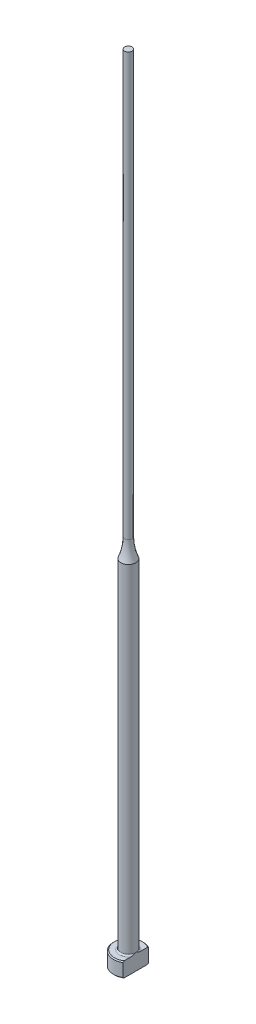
ISO-10303-21;
HEADER;
FILE_DESCRIPTION(('STEP AP214'),'2;1');
FILE_NAME('part.step','',(''),(''),'','','');
FILE_SCHEMA(('AUTOMOTIVE_DESIGN { 1 0 10303 214 1 1 1 1 }'));
ENDSEC;
DATA;
#1=APPLICATION_CONTEXT('core data for automotive mechanical design processes');
#2=APPLICATION_PROTOCOL_DEFINITION('international standard','automotive_design',2000,#1);
#3=PRODUCT_CONTEXT('',#1,'mechanical');
#4=PRODUCT('Part','Part','',(#3));
#5=PRODUCT_RELATED_PRODUCT_CATEGORY('part','',(#4));
#6=PRODUCT_DEFINITION_FORMATION('','',#4);
#7=PRODUCT_DEFINITION_CONTEXT('part definition',#1,'design');
#8=PRODUCT_DEFINITION('design','',#6,#7);
#9=PRODUCT_DEFINITION_SHAPE('','',#8);
#10=(LENGTH_UNIT() NAMED_UNIT(*) SI_UNIT(.MILLI.,.METRE.));
#11=(NAMED_UNIT(*) PLANE_ANGLE_UNIT() SI_UNIT($,.RADIAN.));
#12=(NAMED_UNIT(*) SI_UNIT($,.STERADIAN.) SOLID_ANGLE_UNIT());
#13=UNCERTAINTY_MEASURE_WITH_UNIT(LENGTH_MEASURE(1.E-05),#10,'distance_accuracy_value','');
#14=(GEOMETRIC_REPRESENTATION_CONTEXT(3) GLOBAL_UNCERTAINTY_ASSIGNED_CONTEXT((#13)) GLOBAL_UNIT_ASSIGNED_CONTEXT((#10,
#11,#12)) REPRESENTATION_CONTEXT('',''));
#15=CARTESIAN_POINT('',(0.,0.,0.));
#16=DIRECTION('',(0.,0.,1.));
#17=DIRECTION('',(1.,0.,0.));
#18=AXIS2_PLACEMENT_3D('',#15,#16,#17);
#19=CARTESIAN_POINT('',(-2.99999999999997,3.,0.));
#20=DIRECTION('',(0.,1.,0.));
#21=DIRECTION('',(0.,0.,1.));
#22=AXIS2_PLACEMENT_3D('',#19,#20,#21);
#23=PLANE('',#22);
#24=CARTESIAN_POINT('',(0.,3.,0.));
#25=DIRECTION('',(0.,1.,0.));
#26=DIRECTION('',(0.,0.,1.));
#27=AXIS2_PLACEMENT_3D('',#24,#25,#26);
#28=CIRCLE('',#27,2.79999999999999);
#29=CARTESIAN_POINT('',(1.49999999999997,3.,-2.36431808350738));
#30=VERTEX_POINT('',#29);
#31=CARTESIAN_POINT('',(1.49999999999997,3.,2.36431808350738));
#32=VERTEX_POINT('',#31);
#33=EDGE_CURVE('E187',#30,#32,#28,.T.);
#34=ORIENTED_EDGE('',*,*,#33,.T.);
#35=DIRECTION('',(0.,0.,-1.));
#36=VECTOR('',#35,1.);
#37=CARTESIAN_POINT('',(1.49999999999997,3.,0.));
#38=LINE('',#37,#36);
#39=CARTESIAN_POINT('',(1.49999999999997,3.00000000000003,0.99498743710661));
#40=VERTEX_POINT('',#39);
#41=EDGE_CURVE('E57',#32,#40,#38,.T.);
#42=ORIENTED_EDGE('',*,*,#41,.T.);
#43=CARTESIAN_POINT('',(0.,3.,0.));
#44=DIRECTION('',(0.,1.,0.));
#45=DIRECTION('',(0.,0.,1.));
#46=AXIS2_PLACEMENT_3D('',#43,#44,#45);
#47=CIRCLE('',#46,1.79999999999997);
#48=CARTESIAN_POINT('',(1.49999999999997,3.00000000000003,-0.994987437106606));
#49=VERTEX_POINT('',#48);
#50=EDGE_CURVE('E108',#40,#49,#47,.F.);
#51=ORIENTED_EDGE('',*,*,#50,.T.);
#52=EDGE_CURVE('E137',#49,#30,#38,.T.);
#53=ORIENTED_EDGE('',*,*,#52,.T.);
#54=EDGE_LOOP('',(#34,#42,#51,#53));
#55=FACE_BOUND('',#54,.T.);
#56=ADVANCED_FACE('F32',(#55),#23,.T.);
#57=CARTESIAN_POINT('',(0.,259.958771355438,0.));
#58=DIRECTION('',(0.,1.,0.));
#59=DIRECTION('',(0.,0.,1.));
#60=AXIS2_PLACEMENT_3D('',#57,#58,#59);
#61=CYLINDRICAL_SURFACE('',#60,2.99999999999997);
#62=CARTESIAN_POINT('',(0.,2.80000000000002,0.));
#63=DIRECTION('',(0.,1.,0.));
#64=DIRECTION('',(0.,0.,1.));
#65=AXIS2_PLACEMENT_3D('',#62,#63,#64);
#66=CIRCLE('',#65,2.99999999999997);
#67=CARTESIAN_POINT('',(1.49999999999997,2.80000000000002,2.5980762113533));
#68=VERTEX_POINT('',#67);
#69=CARTESIAN_POINT('',(1.49999999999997,2.80000000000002,-2.5980762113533));
#70=VERTEX_POINT('',#69);
#71=EDGE_CURVE('E105',#68,#70,#66,.F.);
#72=ORIENTED_EDGE('',*,*,#71,.T.);
#73=DIRECTION('',(0.,-1.,0.));
#74=VECTOR('',#73,1.);
#75=CARTESIAN_POINT('',(1.49999999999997,160.,-2.5980762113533));
#76=LINE('',#75,#74);
#77=CARTESIAN_POINT('',(1.49999999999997,0.200000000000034,-2.5980762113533));
#78=VERTEX_POINT('',#77);
#79=EDGE_CURVE('E193',#70,#78,#76,.T.);
#80=ORIENTED_EDGE('',*,*,#79,.T.);
#81=CARTESIAN_POINT('',(0.,0.200000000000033,0.));
#82=DIRECTION('',(0.,-1.,0.));
#83=DIRECTION('',(0.,0.,-1.));
#84=AXIS2_PLACEMENT_3D('',#81,#82,#83);
#85=CIRCLE('',#84,2.99999999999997);
#86=CARTESIAN_POINT('',(1.49999999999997,0.200000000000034,2.5980762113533));
#87=VERTEX_POINT('',#86);
#88=EDGE_CURVE('E100',#78,#87,#85,.F.);
#89=ORIENTED_EDGE('',*,*,#88,.T.);
#90=DIRECTION('',(0.,-1.,0.));
#91=VECTOR('',#90,1.);
#92=CARTESIAN_POINT('',(1.49999999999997,160.,2.5980762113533));
#93=LINE('',#92,#91);
#94=EDGE_CURVE('E93',#68,#87,#93,.T.);
#95=ORIENTED_EDGE('',*,*,#94,.F.);
#96=EDGE_LOOP('',(#72,#80,#89,#95));
#97=FACE_BOUND('',#96,.T.);
#98=ADVANCED_FACE('F158',(#97),#61,.T.);
#99=CARTESIAN_POINT('',(0.,0.,0.));
#100=DIRECTION('',(0.,-1.,0.));
#101=DIRECTION('',(0.,0.,-1.));
#102=AXIS2_PLACEMENT_3D('',#99,#100,#101);
#103=PLANE('',#102);
#104=CARTESIAN_POINT('',(0.,0.,0.));
#105=DIRECTION('',(0.,-1.,0.));
#106=DIRECTION('',(0.,0.,-1.));
#107=AXIS2_PLACEMENT_3D('',#104,#105,#106);
#108=CIRCLE('',#107,2.79999999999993);
#109=CARTESIAN_POINT('',(1.49999999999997,0.,2.36431808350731));
#110=VERTEX_POINT('',#109);
#111=CARTESIAN_POINT('',(1.49999999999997,0.,-2.36431808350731));
#112=VERTEX_POINT('',#111);
#113=EDGE_CURVE('E98',#110,#112,#108,.T.);
#114=ORIENTED_EDGE('',*,*,#113,.T.);
#115=DIRECTION('',(0.,0.,1.));
#116=VECTOR('',#115,1.);
#117=CARTESIAN_POINT('',(1.49999999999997,0.,-2.5980762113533));
#118=LINE('',#117,#116);
#119=EDGE_CURVE('E83',#112,#110,#118,.T.);
#120=ORIENTED_EDGE('',*,*,#119,.T.);
#121=EDGE_LOOP('',(#114,#120));
#122=FACE_BOUND('',#121,.T.);
#123=ADVANCED_FACE('F103',(#122),#103,.T.);
#124=CARTESIAN_POINT('',(0.,3.,0.));
#125=DIRECTION('',(0.,-1.,0.));
#126=DIRECTION('',(0.,0.,-1.));
#127=AXIS2_PLACEMENT_3D('',#124,#125,#126);
#128=CONICAL_SURFACE('',#127,2.79999999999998,0.785398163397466);
#129=ORIENTED_EDGE('',*,*,#71,.F.);
#130=CARTESIAN_POINT('',(1.49999999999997,-0.111741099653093,5.71827621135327));
#131=CARTESIAN_POINT('',(1.49999999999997,0.0136183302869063,5.58866816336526));
#132=CARTESIAN_POINT('',(1.49999999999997,0.138843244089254,5.45892957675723));
#133=CARTESIAN_POINT('',(1.49999999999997,0.388944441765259,5.19911365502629));
#134=CARTESIAN_POINT('',(1.49999999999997,0.513820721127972,5.06903631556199));
#135=CARTESIAN_POINT('',(1.49999999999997,0.763205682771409,4.80840180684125));
#136=CARTESIAN_POINT('',(1.49999999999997,0.887714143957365,4.67784442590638));
#137=CARTESIAN_POINT('',(1.49999999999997,1.13618059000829,4.41620813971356));
#138=CARTESIAN_POINT('',(1.49999999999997,1.26013857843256,4.28512923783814));
#139=CARTESIAN_POINT('',(1.49999999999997,1.50488975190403,4.02490837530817));
#140=CARTESIAN_POINT('',(1.49999999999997,1.6256969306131,3.89577958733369));
#141=CARTESIAN_POINT('',(1.49999999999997,1.86640694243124,3.63668213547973));
#142=CARTESIAN_POINT('',(1.49999999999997,1.98630978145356,3.50671347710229));
#143=CARTESIAN_POINT('',(1.49999999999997,2.22486033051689,3.24567921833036));
#144=CARTESIAN_POINT('',(1.49999999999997,2.34350830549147,3.11461386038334));
#145=CARTESIAN_POINT('',(1.49999999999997,2.57907716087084,2.85094268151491));
#146=CARTESIAN_POINT('',(1.49999999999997,2.69599811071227,2.71833692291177));
#147=CARTESIAN_POINT('',(1.49999999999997,2.88262371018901,2.50255231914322));
#148=CARTESIAN_POINT('',(1.49999999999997,2.95312454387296,2.42006293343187));
#149=CARTESIAN_POINT('',(1.49999999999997,3.0928709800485,2.25401084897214));
#150=CARTESIAN_POINT('',(1.49999999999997,3.16211645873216,2.17044804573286));
#151=CARTESIAN_POINT('',(1.49999999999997,3.29964684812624,2.00105967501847));
#152=CARTESIAN_POINT('',(1.49999999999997,3.36791386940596,1.91521952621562));
#153=CARTESIAN_POINT('',(1.49999999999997,3.50205840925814,1.74171392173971));
#154=CARTESIAN_POINT('',(1.49999999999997,3.56793649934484,1.65404891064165));
#155=CARTESIAN_POINT('',(1.49999999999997,3.69728151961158,1.47490236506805));
#156=CARTESIAN_POINT('',(1.49999999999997,3.76069661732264,1.38338308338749));
#157=CARTESIAN_POINT('',(1.49999999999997,3.8823953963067,1.19675661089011));
#158=CARTESIAN_POINT('',(1.49999999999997,3.94067201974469,1.10164473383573));
#159=CARTESIAN_POINT('',(1.49999999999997,4.04841325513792,0.908008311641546));
#160=CARTESIAN_POINT('',(1.49999999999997,4.0979780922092,0.809540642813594));
#161=CARTESIAN_POINT('',(1.49999999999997,4.18432188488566,0.607192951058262));
#162=CARTESIAN_POINT('',(1.49999999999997,4.22114374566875,0.503332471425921));
#163=CARTESIAN_POINT('',(1.49999999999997,4.26099935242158,0.347577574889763));
#164=CARTESIAN_POINT('',(1.49999999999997,4.27157029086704,0.297609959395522));
#165=CARTESIAN_POINT('',(1.49999999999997,4.28794860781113,0.196885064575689));
#166=CARTESIAN_POINT('',(1.49999999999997,4.29375640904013,0.146127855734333));
#167=CARTESIAN_POINT('',(1.49999999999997,4.30019707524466,0.0444388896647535));
#168=CARTESIAN_POINT('',(1.49999999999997,4.30084594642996,-0.00649183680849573));
#169=CARTESIAN_POINT('',(1.49999999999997,4.29696416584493,-0.108155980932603));
#170=CARTESIAN_POINT('',(1.49999999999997,4.29243308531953,-0.15888938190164));
#171=CARTESIAN_POINT('',(1.49999999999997,4.27856915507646,-0.259234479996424));
#172=CARTESIAN_POINT('',(1.49999999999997,4.26927821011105,-0.30885208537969));
#173=CARTESIAN_POINT('',(1.49999999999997,4.24647108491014,-0.407110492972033));
#174=CARTESIAN_POINT('',(1.49999999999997,4.2329532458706,-0.455750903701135));
#175=CARTESIAN_POINT('',(1.49999999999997,4.20226175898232,-0.552149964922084));
#176=CARTESIAN_POINT('',(1.49999999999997,4.18506801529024,-0.599902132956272));
#177=CARTESIAN_POINT('',(1.49999999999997,4.14771387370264,-0.694205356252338));
#178=CARTESIAN_POINT('',(1.49999999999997,4.1275540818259,-0.740756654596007));
#179=CARTESIAN_POINT('',(1.49999999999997,4.06327696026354,-0.879166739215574));
#180=CARTESIAN_POINT('',(1.49999999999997,4.01551721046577,-0.969329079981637));
#181=CARTESIAN_POINT('',(1.49999999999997,3.91367909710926,-1.1460431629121));
#182=CARTESIAN_POINT('',(1.49999999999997,3.85959300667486,-1.23259031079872));
#183=CARTESIAN_POINT('',(1.49999999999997,3.74697968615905,-1.40321348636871));
#184=CARTESIAN_POINT('',(1.49999999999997,3.68843573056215,-1.48727838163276));
#185=CARTESIAN_POINT('',(1.49999999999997,3.56843845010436,-1.65322187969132));
#186=CARTESIAN_POINT('',(1.49999999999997,3.50698656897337,-1.73510153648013));
#187=CARTESIAN_POINT('',(1.49999999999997,3.38115673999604,-1.89829823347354));
#188=CARTESIAN_POINT('',(1.49999999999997,3.31675092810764,-1.97959369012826));
#189=CARTESIAN_POINT('',(1.49999999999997,3.18634068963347,-2.14090082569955));
#190=CARTESIAN_POINT('',(1.49999999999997,3.12033609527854,-2.22091236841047));
#191=CARTESIAN_POINT('',(1.49999999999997,2.92086431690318,-2.45906508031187));
#192=CARTESIAN_POINT('',(1.49999999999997,2.78562663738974,-2.61572090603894));
#193=CARTESIAN_POINT('',(1.49999999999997,2.53554498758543,-2.90006295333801));
#194=CARTESIAN_POINT('',(1.49999999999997,2.42114543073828,-3.02814382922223));
#195=CARTESIAN_POINT('',(1.49999999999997,2.19093557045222,-3.28303767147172));
#196=CARTESIAN_POINT('',(1.49999999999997,2.07512522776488,-3.40985060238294));
#197=CARTESIAN_POINT('',(1.49999999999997,1.72597067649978,-3.7891384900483));
#198=CARTESIAN_POINT('',(1.49999999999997,1.49111760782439,-4.04022177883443));
#199=CARTESIAN_POINT('',(1.49999999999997,1.02882478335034,-4.52992803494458));
#200=CARTESIAN_POINT('',(1.49999999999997,0.801477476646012,-4.76863870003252));
#201=CARTESIAN_POINT('',(1.49999999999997,0.459548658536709,-5.12558036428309));
#202=CARTESIAN_POINT('',(1.49999999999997,0.345484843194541,-5.2443077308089));
#203=CARTESIAN_POINT('',(1.49999999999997,0.117071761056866,-5.48148573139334));
#204=CARTESIAN_POINT('',(1.49999999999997,0.00272249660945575,-5.59993636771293));
#205=CARTESIAN_POINT('',(1.49999999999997,-0.111741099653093,-5.71827621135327));
#206=B_SPLINE_CURVE_WITH_KNOTS('',3,(#130,#131,#132,#133,#134,#135,#136,#137,#138,#139,#140,
#141,#142,#143,#144,#145,#146,#147,#148,#149,#150,#151,#152,#153,#154,#155,#156,#157,#158,#159,
#160,#161,#162,#163,#164,#165,#166,#167,#168,#169,#170,#171,#172,#173,#174,#175,#176,#177,#178,
#179,#180,#181,#182,#183,#184,#185,#186,#187,#188,#189,#190,#191,#192,#193,#194,#195,#196,#197,
#198,#199,#200,#201,#202,#203,#204,#205),.UNSPECIFIED.,.F.,.F.,(4,2,2,2,2,2,2,2,2,2,2,2,2,2,2,2,
2,2,2,2,2,2,2,2,2,2,2,2,2,2,2,2,2,2,2,2,2,4),(0.,0.540943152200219,1.08189327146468,
1.62312052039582,2.16434426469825,2.69482920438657,3.22531067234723,3.75567781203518,
4.2860235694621,4.61155053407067,4.93710943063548,5.2661094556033,5.59503024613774,
5.92894782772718,6.26331713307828,6.59354403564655,6.92264800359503,7.0756747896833,
7.22868799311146,7.38122626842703,7.53377717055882,7.68500755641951,7.83629736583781,
7.98843643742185,8.14054446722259,8.44618799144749,8.75220879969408,9.05944044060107,
9.36652111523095,9.67764287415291,9.98879742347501,10.6095925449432,11.1247803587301,
11.6399825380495,12.6713544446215,13.6603005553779,14.1542238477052,14.6481430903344),.UNSPECIFIED.);
#207=EDGE_CURVE('E136',#68,#32,#206,.T.);
#208=ORIENTED_EDGE('',*,*,#207,.T.);
#209=ORIENTED_EDGE('',*,*,#33,.F.);
#210=EDGE_CURVE('E128',#30,#70,#206,.T.);
#211=ORIENTED_EDGE('',*,*,#210,.T.);
#212=EDGE_LOOP('',(#129,#208,#209,#211));
#213=FACE_BOUND('',#212,.T.);
#214=ADVANCED_FACE('F144',(#213),#128,.T.);
#215=CARTESIAN_POINT('',(0.,0.200000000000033,0.));
#216=DIRECTION('',(0.,1.,0.));
#217=DIRECTION('',(0.,0.,1.));
#218=AXIS2_PLACEMENT_3D('',#215,#216,#217);
#219=CONICAL_SURFACE('',#218,2.99999999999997,0.785398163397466);
#220=ORIENTED_EDGE('',*,*,#88,.F.);
#221=CARTESIAN_POINT('',(1.49999999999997,3.11174109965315,-5.71827621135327));
#222=CARTESIAN_POINT('',(1.49999999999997,2.98638166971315,-5.58866816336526));
#223=CARTESIAN_POINT('',(1.49999999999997,2.8611567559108,-5.45892957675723));
#224=CARTESIAN_POINT('',(1.49999999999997,2.6110555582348,-5.19911365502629));
#225=CARTESIAN_POINT('',(1.49999999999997,2.48617927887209,-5.06903631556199));
#226=CARTESIAN_POINT('',(1.49999999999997,2.23679431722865,-4.80840180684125));
#227=CARTESIAN_POINT('',(1.49999999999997,2.11228585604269,-4.67784442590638));
#228=CARTESIAN_POINT('',(1.49999999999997,1.86381940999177,-4.41620813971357));
#229=CARTESIAN_POINT('',(1.49999999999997,1.7398614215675,-4.28512923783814));
#230=CARTESIAN_POINT('',(1.49999999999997,1.49511024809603,-4.02490837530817));
#231=CARTESIAN_POINT('',(1.49999999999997,1.37430306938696,-3.89577958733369));
#232=CARTESIAN_POINT('',(1.49999999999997,1.13359305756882,-3.63668213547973));
#233=CARTESIAN_POINT('',(1.49999999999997,1.0136902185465,-3.50671347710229));
#234=CARTESIAN_POINT('',(1.49999999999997,0.775139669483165,-3.24567921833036));
#235=CARTESIAN_POINT('',(1.49999999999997,0.656491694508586,-3.11461386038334));
#236=CARTESIAN_POINT('',(1.49999999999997,0.420922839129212,-2.85094268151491));
#237=CARTESIAN_POINT('',(1.49999999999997,0.304001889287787,-2.71833692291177));
#238=CARTESIAN_POINT('',(1.49999999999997,0.117376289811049,-2.50255231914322));
#239=CARTESIAN_POINT('',(1.49999999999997,0.0468754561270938,-2.42006293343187));
#240=CARTESIAN_POINT('',(1.49999999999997,-0.0928709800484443,-2.25401084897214));
#241=CARTESIAN_POINT('',(1.49999999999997,-0.162116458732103,-2.17044804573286));
#242=CARTESIAN_POINT('',(1.49999999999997,-0.299646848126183,-2.00105967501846));
#243=CARTESIAN_POINT('',(1.49999999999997,-0.367913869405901,-1.91521952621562));
#244=CARTESIAN_POINT('',(1.49999999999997,-0.502058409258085,-1.74171392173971));
#245=CARTESIAN_POINT('',(1.49999999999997,-0.567936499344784,-1.65404891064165));
#246=CARTESIAN_POINT('',(1.49999999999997,-0.697281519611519,-1.47490236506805));
#247=CARTESIAN_POINT('',(1.49999999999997,-0.760696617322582,-1.38338308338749));
#248=CARTESIAN_POINT('',(1.49999999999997,-0.882395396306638,-1.19675661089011));
#249=CARTESIAN_POINT('',(1.49999999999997,-0.940672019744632,-1.10164473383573));
#250=CARTESIAN_POINT('',(1.49999999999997,-1.04841325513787,-0.908008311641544));
#251=CARTESIAN_POINT('',(1.49999999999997,-1.09797809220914,-0.809540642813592));
#252=CARTESIAN_POINT('',(1.49999999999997,-1.1843218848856,-0.60719295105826));
#253=CARTESIAN_POINT('',(1.49999999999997,-1.22114374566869,-0.503332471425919));
#254=CARTESIAN_POINT('',(1.49999999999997,-1.26099935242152,-0.347577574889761));
#255=CARTESIAN_POINT('',(1.49999999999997,-1.27157029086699,-0.29760995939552));
#256=CARTESIAN_POINT('',(1.49999999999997,-1.28794860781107,-0.196885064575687));
#257=CARTESIAN_POINT('',(1.49999999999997,-1.29375640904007,-0.146127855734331));
#258=CARTESIAN_POINT('',(1.49999999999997,-1.30019707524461,-0.0444388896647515));
#259=CARTESIAN_POINT('',(1.49999999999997,-1.3008459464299,0.00649183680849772));
#260=CARTESIAN_POINT('',(1.49999999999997,-1.29696416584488,0.108155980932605));
#261=CARTESIAN_POINT('',(1.49999999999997,-1.29243308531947,0.158889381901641));
#262=CARTESIAN_POINT('',(1.49999999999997,-1.2785691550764,0.259234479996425));
#263=CARTESIAN_POINT('',(1.49999999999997,-1.26927821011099,0.308852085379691));
#264=CARTESIAN_POINT('',(1.49999999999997,-1.24647108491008,0.407110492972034));
#265=CARTESIAN_POINT('',(1.49999999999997,-1.23295324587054,0.455750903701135));
#266=CARTESIAN_POINT('',(1.49999999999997,-1.20226175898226,0.552149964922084));
#267=CARTESIAN_POINT('',(1.49999999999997,-1.18506801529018,0.599902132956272));
#268=CARTESIAN_POINT('',(1.49999999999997,-1.14771387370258,0.694205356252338));
#269=CARTESIAN_POINT('',(1.49999999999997,-1.12755408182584,0.740756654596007));
#270=CARTESIAN_POINT('',(1.49999999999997,-1.06327696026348,0.879166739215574));
#271=CARTESIAN_POINT('',(1.49999999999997,-1.01551721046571,0.969329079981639));
#272=CARTESIAN_POINT('',(1.49999999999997,-0.913679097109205,1.1460431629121));
#273=CARTESIAN_POINT('',(1.49999999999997,-0.8595930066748,1.23259031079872));
#274=CARTESIAN_POINT('',(1.49999999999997,-0.746979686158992,1.40321348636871));
#275=CARTESIAN_POINT('',(1.49999999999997,-0.688435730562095,1.48727838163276));
#276=CARTESIAN_POINT('',(1.49999999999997,-0.568438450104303,1.65322187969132));
#277=CARTESIAN_POINT('',(1.49999999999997,-0.506986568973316,1.73510153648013));
#278=CARTESIAN_POINT('',(1.49999999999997,-0.381156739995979,1.89829823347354));
#279=CARTESIAN_POINT('',(1.49999999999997,-0.316750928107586,1.97959369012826));
#280=CARTESIAN_POINT('',(1.49999999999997,-0.186340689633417,2.14090082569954));
#281=CARTESIAN_POINT('',(1.49999999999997,-0.120336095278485,2.22091236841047));
#282=CARTESIAN_POINT('',(1.49999999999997,0.0791356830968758,2.45906508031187));
#283=CARTESIAN_POINT('',(1.49999999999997,0.214373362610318,2.61572090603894));
#284=CARTESIAN_POINT('',(1.49999999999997,0.46445501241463,2.90006295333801));
#285=CARTESIAN_POINT('',(1.49999999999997,0.578854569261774,3.02814382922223));
#286=CARTESIAN_POINT('',(1.49999999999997,0.809064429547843,3.28303767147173));
#287=CARTESIAN_POINT('',(1.49999999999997,0.924874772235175,3.40985060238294));
#288=CARTESIAN_POINT('',(1.49999999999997,1.27402932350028,3.78913849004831));
#289=CARTESIAN_POINT('',(1.49999999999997,1.50888239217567,4.04022177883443));
#290=CARTESIAN_POINT('',(1.49999999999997,1.97117521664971,4.52992803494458));
#291=CARTESIAN_POINT('',(1.49999999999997,2.19852252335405,4.76863870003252));
#292=CARTESIAN_POINT('',(1.49999999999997,2.54045134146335,5.12558036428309));
#293=CARTESIAN_POINT('',(1.49999999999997,2.65451515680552,5.2443077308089));
#294=CARTESIAN_POINT('',(1.49999999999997,2.88292823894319,5.48148573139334));
#295=CARTESIAN_POINT('',(1.49999999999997,2.9972775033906,5.59993636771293));
#296=CARTESIAN_POINT('',(1.49999999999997,3.11174109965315,5.71827621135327));
#297=B_SPLINE_CURVE_WITH_KNOTS('',3,(#221,#222,#223,#224,#225,#226,#227,#228,#229,#230,#231,
#232,#233,#234,#235,#236,#237,#238,#239,#240,#241,#242,#243,#244,#245,#246,#247,#248,#249,#250,
#251,#252,#253,#254,#255,#256,#257,#258,#259,#260,#261,#262,#263,#264,#265,#266,#267,#268,#269,
#270,#271,#272,#273,#274,#275,#276,#277,#278,#279,#280,#281,#282,#283,#284,#285,#286,#287,#288,
#289,#290,#291,#292,#293,#294,#295,#296),.UNSPECIFIED.,.F.,.F.,(4,2,2,2,2,2,2,2,2,2,2,2,2,2,2,2,
2,2,2,2,2,2,2,2,2,2,2,2,2,2,2,2,2,2,2,2,2,4),(0.,0.540943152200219,1.08189327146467,
1.62312052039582,2.16434426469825,2.69482920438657,3.22531067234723,3.75567781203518,
4.28602356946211,4.61155053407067,4.93710943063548,5.2661094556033,5.59503024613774,
5.92894782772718,6.26331713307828,6.59354403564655,6.92264800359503,7.0756747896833,
7.22868799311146,7.38122626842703,7.53377717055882,7.68500755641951,7.83629736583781,
7.98843643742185,8.14054446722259,8.4461879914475,8.75220879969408,9.05944044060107,
9.36652111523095,9.6776428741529,9.98879742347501,10.6095925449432,11.1247803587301,
11.6399825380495,12.6713544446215,13.6603005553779,14.1542238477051,14.6481430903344),.UNSPECIFIED.);
#298=EDGE_CURVE('E86',#78,#112,#297,.T.);
#299=ORIENTED_EDGE('',*,*,#298,.T.);
#300=ORIENTED_EDGE('',*,*,#113,.F.);
#301=EDGE_CURVE('E89',#110,#87,#297,.T.);
#302=ORIENTED_EDGE('',*,*,#301,.T.);
#303=EDGE_LOOP('',(#220,#299,#300,#302));
#304=FACE_BOUND('',#303,.T.);
#305=ADVANCED_FACE('F97',(#304),#219,.T.);
#306=CARTESIAN_POINT('',(0.,3.30000000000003,0.));
#307=DIRECTION('',(0.,1.,0.));
#308=DIRECTION('',(0.,0.,1.));
#309=AXIS2_PLACEMENT_3D('',#306,#307,#308);
#310=TOROIDAL_SURFACE('',#309,1.79999999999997,0.3);
#311=CARTESIAN_POINT('',(1.49999999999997,3.30000000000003,0.));
#312=CARTESIAN_POINT('',(1.49999999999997,3.300000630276,3.41555678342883E-12));
#313=CARTESIAN_POINT('',(1.49999999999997,3.30000126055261,-1.15373640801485E-07));
#314=CARTESIAN_POINT('',(1.49999999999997,3.3000024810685,-4.90631575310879E-07));
#315=CARTESIAN_POINT('',(1.49999999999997,3.30000307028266,-7.53296670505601E-07));
#316=CARTESIAN_POINT('',(1.49999999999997,3.30000424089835,-1.38757096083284E-06));
#317=CARTESIAN_POINT('',(1.49999999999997,3.300004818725,-1.76563001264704E-06));
#318=CARTESIAN_POINT('',(1.49999999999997,3.30000591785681,-2.58768006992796E-06));
#319=CARTESIAN_POINT('',(1.49999999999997,3.30000643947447,-3.03127014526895E-06));
#320=CARTESIAN_POINT('',(1.49999999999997,3.30000815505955,-4.60021967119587E-06));
#321=CARTESIAN_POINT('',(1.49999999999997,3.30000927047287,-5.8124152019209E-06));
#322=CARTESIAN_POINT('',(1.49999999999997,3.30001128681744,-8.33989413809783E-06));
#323=CARTESIAN_POINT('',(1.49999999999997,3.30001219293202,-9.65128157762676E-06));
#324=CARTESIAN_POINT('',(1.49999999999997,3.30001551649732,-1.46782505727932E-05));
#325=CARTESIAN_POINT('',(1.49999999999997,3.30001775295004,-1.8517976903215E-05));
#326=CARTESIAN_POINT('',(1.49999999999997,3.30002148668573,-2.61616194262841E-05));
#327=CARTESIAN_POINT('',(1.49999999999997,3.30002302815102,-2.99447742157E-05));
#328=CARTESIAN_POINT('',(1.49999999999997,3.30002943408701,-4.58003743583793E-05));
#329=CARTESIAN_POINT('',(1.49999999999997,3.3000341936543,-5.79079078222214E-05));
#330=CARTESIAN_POINT('',(1.49999999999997,3.30004197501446,-8.07263755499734E-05));
#331=CARTESIAN_POINT('',(1.49999999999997,3.30004514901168,-9.13834709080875E-05));
#332=CARTESIAN_POINT('',(1.49999999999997,3.30006989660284,-0.000167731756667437));
#333=CARTESIAN_POINT('',(1.49999999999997,3.30010092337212,-0.000229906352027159));
#334=CARTESIAN_POINT('',(1.49999999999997,3.30021632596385,-0.000470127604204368));
#335=CARTESIAN_POINT('',(1.49999999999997,3.30029368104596,-0.000650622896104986));
#336=CARTESIAN_POINT('',(1.49999999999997,3.30059619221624,-0.00134589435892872));
#337=CARTESIAN_POINT('',(1.49999999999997,3.30082870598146,-0.00185814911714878));
#338=CARTESIAN_POINT('',(1.49999999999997,3.30176696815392,-0.00393547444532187));
#339=CARTESIAN_POINT('',(1.49999999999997,3.30246445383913,-0.00550332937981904));
#340=CARTESIAN_POINT('',(1.49999999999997,3.31426785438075,-0.0320229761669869));
#341=CARTESIAN_POINT('',(1.49999999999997,3.32544800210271,-0.0569503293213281));
#342=CARTESIAN_POINT('',(1.49999999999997,3.34725700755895,-0.105984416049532));
#343=CARTESIAN_POINT('',(1.49999999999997,3.35789134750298,-0.130088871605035));
#344=CARTESIAN_POINT('',(1.49999999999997,3.38015321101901,-0.181096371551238));
#345=CARTESIAN_POINT('',(1.49999999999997,3.39175804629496,-0.208009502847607));
#346=CARTESIAN_POINT('',(1.49999999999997,3.41469034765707,-0.262264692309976));
#347=CARTESIAN_POINT('',(1.49999999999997,3.42601398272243,-0.289608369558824));
#348=CARTESIAN_POINT('',(1.49999999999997,3.45363212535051,-0.35820378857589));
#349=CARTESIAN_POINT('',(1.49999999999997,3.46959026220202,-0.39959288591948));
#350=CARTESIAN_POINT('',(1.49999999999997,3.49940505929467,-0.482097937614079));
#351=CARTESIAN_POINT('',(1.49999999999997,3.51330033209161,-0.523199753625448));
#352=CARTESIAN_POINT('',(1.49999999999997,3.53552507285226,-0.595497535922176));
#353=CARTESIAN_POINT('',(1.49999999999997,3.54436834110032,-0.626532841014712));
#354=CARTESIAN_POINT('',(1.49999999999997,3.56052427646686,-0.6891760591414));
#355=CARTESIAN_POINT('',(1.49999999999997,3.5678279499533,-0.720786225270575));
#356=CARTESIAN_POINT('',(1.49999999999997,3.5875075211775,-0.819524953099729));
#357=CARTESIAN_POINT('',(1.49999999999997,3.59661044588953,-0.88742909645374));
#358=CARTESIAN_POINT('',(1.49999999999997,3.60059842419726,-0.991180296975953));
#359=CARTESIAN_POINT('',(1.49999999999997,3.60019840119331,-1.02684364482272));
#360=CARTESIAN_POINT('',(1.49999999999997,3.59497085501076,-1.097505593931));
#361=CARTESIAN_POINT('',(1.49999999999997,3.59019295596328,-1.13250716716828));
#362=CARTESIAN_POINT('',(1.49999999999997,3.57687734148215,-1.19353096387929));
#363=CARTESIAN_POINT('',(1.49999999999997,3.56943875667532,-1.21978854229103));
#364=CARTESIAN_POINT('',(1.49999999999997,3.55063748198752,-1.27094658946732));
#365=CARTESIAN_POINT('',(1.49999999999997,3.53927342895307,-1.29584658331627));
#366=CARTESIAN_POINT('',(1.49999999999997,3.51660016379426,-1.33501873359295));
#367=CARTESIAN_POINT('',(1.49999999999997,3.50657738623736,-1.35003296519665));
#368=CARTESIAN_POINT('',(1.49999999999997,3.48437469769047,-1.37837252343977));
#369=CARTESIAN_POINT('',(1.49999999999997,3.47219867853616,-1.39170082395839));
#370=CARTESIAN_POINT('',(1.49999999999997,3.44835614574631,-1.41349417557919));
#371=CARTESIAN_POINT('',(1.49999999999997,3.43709185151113,-1.42239673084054));
#372=CARTESIAN_POINT('',(1.49999999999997,3.41325256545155,-1.43825467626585));
#373=CARTESIAN_POINT('',(1.49999999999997,3.40067804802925,-1.44521076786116));
#374=CARTESIAN_POINT('',(1.49999999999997,3.37433767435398,-1.45677158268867));
#375=CARTESIAN_POINT('',(1.49999999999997,3.36056203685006,-1.46135438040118));
#376=CARTESIAN_POINT('',(1.49999999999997,3.33237324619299,-1.46767730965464));
#377=CARTESIAN_POINT('',(1.49999999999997,3.31796076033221,-1.46942034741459));
#378=CARTESIAN_POINT('',(1.49999999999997,3.29122479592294,-1.4698720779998));
#379=CARTESIAN_POINT('',(1.49999999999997,3.27890664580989,-1.468990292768));
#380=CARTESIAN_POINT('',(1.49999999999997,3.25461019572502,-1.4651157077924));
#381=CARTESIAN_POINT('',(1.49999999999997,3.2426318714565,-1.46212305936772));
#382=CARTESIAN_POINT('',(1.49999999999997,3.21959683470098,-1.4543117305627));
#383=CARTESIAN_POINT('',(1.49999999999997,3.20852542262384,-1.44953579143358));
#384=CARTESIAN_POINT('',(1.49999999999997,3.18721125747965,-1.43840957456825));
#385=CARTESIAN_POINT('',(1.49999999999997,3.1769687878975,-1.43205876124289));
#386=CARTESIAN_POINT('',(1.49999999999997,3.15325976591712,-1.41506353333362));
#387=CARTESIAN_POINT('',(1.49999999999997,3.14027750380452,-1.40374235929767));
#388=CARTESIAN_POINT('',(1.49999999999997,3.11630720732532,-1.37914825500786));
#389=CARTESIAN_POINT('',(1.49999999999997,3.10532420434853,-1.36587054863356));
#390=CARTESIAN_POINT('',(1.49999999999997,3.08100891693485,-1.33197272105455));
#391=CARTESIAN_POINT('',(1.49999999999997,3.06867625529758,-1.31063843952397));
#392=CARTESIAN_POINT('',(1.49999999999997,3.04751867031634,-1.26637455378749));
#393=CARTESIAN_POINT('',(1.49999999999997,3.03869240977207,-1.24344556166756));
#394=CARTESIAN_POINT('',(1.49999999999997,3.01978360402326,-1.18316534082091));
#395=CARTESIAN_POINT('',(1.49999999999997,3.01191472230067,-1.14512623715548));
#396=CARTESIAN_POINT('',(1.49999999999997,3.00188285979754,-1.06789971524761));
#397=CARTESIAN_POINT('',(1.49999999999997,2.99979735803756,-1.02870374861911));
#398=CARTESIAN_POINT('',(1.49999999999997,3.00021727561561,-0.953160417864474));
#399=CARTESIAN_POINT('',(1.49999999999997,3.00240673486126,-0.916808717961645));
#400=CARTESIAN_POINT('',(1.49999999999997,3.0099643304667,-0.844432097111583));
#401=CARTESIAN_POINT('',(1.49999999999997,3.01533462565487,-0.808407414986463));
#402=CARTESIAN_POINT('',(1.49999999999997,3.02828086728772,-0.738670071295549));
#403=CARTESIAN_POINT('',(1.49999999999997,3.03573028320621,-0.704933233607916));
#404=CARTESIAN_POINT('',(1.49999999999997,3.05243174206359,-0.638128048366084));
#405=CARTESIAN_POINT('',(1.49999999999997,3.06167285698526,-0.605056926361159));
#406=CARTESIAN_POINT('',(1.49999999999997,3.08440652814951,-0.53019513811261));
#407=CARTESIAN_POINT('',(1.49999999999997,3.09836576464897,-0.488547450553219));
#408=CARTESIAN_POINT('',(1.49999999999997,3.1283820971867,-0.404954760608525));
#409=CARTESIAN_POINT('',(1.49999999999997,3.14447968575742,-0.363024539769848));
#410=CARTESIAN_POINT('',(1.49999999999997,3.17238454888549,-0.293508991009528));
#411=CARTESIAN_POINT('',(1.49999999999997,3.18384249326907,-0.265781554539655));
#412=CARTESIAN_POINT('',(1.49999999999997,3.20705854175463,-0.210769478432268));
#413=CARTESIAN_POINT('',(1.49999999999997,3.21881265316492,-0.183483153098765));
#414=CARTESIAN_POINT('',(1.49999999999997,3.24136702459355,-0.131772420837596));
#415=CARTESIAN_POINT('',(1.49999999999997,3.25214361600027,-0.107337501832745));
#416=CARTESIAN_POINT('',(1.49999999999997,3.27424746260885,-0.0576321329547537));
#417=CARTESIAN_POINT('',(1.49999999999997,3.28558038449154,-0.0323640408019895));
#418=CARTESIAN_POINT('',(1.49999999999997,3.29753556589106,-0.00550327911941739));
#419=CARTESIAN_POINT('',(1.49999999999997,3.29823307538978,-0.00393537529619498));
#420=CARTESIAN_POINT('',(1.49999999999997,3.29917134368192,-0.00185803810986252));
#421=CARTESIAN_POINT('',(1.49999999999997,3.29940384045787,-0.00134582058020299));
#422=CARTESIAN_POINT('',(1.49999999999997,3.29970633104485,-0.000650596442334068));
#423=CARTESIAN_POINT('',(1.49999999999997,3.29978368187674,-0.000470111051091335));
#424=CARTESIAN_POINT('',(1.49999999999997,3.29989907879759,-0.000229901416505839));
#425=CARTESIAN_POINT('',(1.49999999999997,3.29993010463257,-0.000167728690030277));
#426=CARTESIAN_POINT('',(1.49999999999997,3.29995485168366,-9.13825689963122E-05));
#427=CARTESIAN_POINT('',(1.49999999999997,3.29995802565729,-8.07256241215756E-05));
#428=CARTESIAN_POINT('',(1.49999999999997,3.29996580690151,-5.79074820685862E-05));
#429=CARTESIAN_POINT('',(1.49999999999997,3.29997056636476,-4.5800119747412E-05));
#430=CARTESIAN_POINT('',(1.49999999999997,3.29997697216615,-2.99447119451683E-05));
#431=CARTESIAN_POINT('',(1.49999999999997,3.2999785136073,-2.61615817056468E-05));
#432=CARTESIAN_POINT('',(1.49999999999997,3.2999822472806,-1.85179845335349E-05));
#433=CARTESIAN_POINT('',(1.49999999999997,3.29998448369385,-1.46782782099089E-05));
#434=CARTESIAN_POINT('',(1.49999999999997,3.2999878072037,-9.65132752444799E-06));
#435=CARTESIAN_POINT('',(1.49999999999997,3.299988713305,-8.33994202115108E-06));
#436=CARTESIAN_POINT('',(1.49999999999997,3.29999072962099,-5.81246426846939E-06));
#437=CARTESIAN_POINT('',(1.49999999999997,3.29999184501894,-4.600267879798E-06));
#438=CARTESIAN_POINT('',(1.49999999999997,3.29999356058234,-3.03131394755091E-06));
#439=CARTESIAN_POINT('',(1.49999999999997,3.29999408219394,-2.58772196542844E-06));
#440=CARTESIAN_POINT('',(1.49999999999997,3.2999951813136,-1.76566701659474E-06));
#441=CARTESIAN_POINT('',(1.49999999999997,3.29999575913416,-1.38760497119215E-06));
#442=CARTESIAN_POINT('',(1.49999999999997,3.29999692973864,-7.53323425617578E-07));
#443=CARTESIAN_POINT('',(1.49999999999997,3.29999751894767,-4.90654189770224E-07));
#444=CARTESIAN_POINT('',(1.49999999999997,3.29999873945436,-1.15386267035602E-07));
#445=CARTESIAN_POINT('',(1.49999999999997,3.29999936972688,-3.41554144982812E-12));
#446=CARTESIAN_POINT('',(1.49999999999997,3.30000000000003,0.));
#447=B_SPLINE_CURVE_WITH_KNOTS('',3,(#311,#312,#313,#314,#315,#316,#317,#318,#319,#320,#321,
#322,#323,#324,#325,#326,#327,#328,#329,#330,#331,#332,#333,#334,#335,#336,#337,#338,#339,#340,
#341,#342,#343,#344,#345,#346,#347,#348,#349,#350,#351,#352,#353,#354,#355,#356,#357,#358,#359,
#360,#361,#362,#363,#364,#365,#366,#367,#368,#369,#370,#371,#372,#373,#374,#375,#376,#377,#378,
#379,#380,#381,#382,#383,#384,#385,#386,#387,#388,#389,#390,#391,#392,#393,#394,#395,#396,#397,
#398,#399,#400,#401,#402,#403,#404,#405,#406,#407,#408,#409,#410,#411,#412,#413,#414,#415,#416,
#417,#418,#419,#420,#421,#422,#423,#424,#425,#426,#427,#428,#429,#430,#431,#432,#433,#434,#435,
#436,#437,#438,#439,#440,#441,#442,#443,#444,#445,#446),.UNSPECIFIED.,.T.,.F.,(4,2,2,2,2,2,2,2,
2,2,2,2,2,2,2,2,2,2,2,2,2,2,2,2,2,2,2,2,2,2,2,2,2,2,2,2,2,2,2,2,2,2,2,2,2,2,2,2,2,2,2,2,2,2,2,2,
2,2,2,2,2,2,2,2,2,2,2,4),(0.,1.88906036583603E-06,3.8150959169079E-06,5.87892837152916E-06,
7.93062024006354E-06,1.28480890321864E-05,1.76261717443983E-05,3.0909918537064E-05,
4.31529750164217E-05,8.21699329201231E-05,0.000115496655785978,0.000323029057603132,
0.000912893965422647,0.00259963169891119,0.00774858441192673,0.0896975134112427,
0.168737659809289,0.256660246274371,0.345444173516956,0.478492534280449,0.608603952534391,
0.705372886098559,0.802692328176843,1.00719557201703,1.11399616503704,1.21960092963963,
1.30124317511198,1.38291380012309,1.43690814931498,1.49080588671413,1.53371524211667,
1.57660911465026,1.61989249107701,1.66313154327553,1.69999492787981,1.73685567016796,
1.77288440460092,1.80892540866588,1.86031324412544,1.91182866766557,1.98534297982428,
2.05882922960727,2.1747172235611,2.29215041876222,2.40123170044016,2.51038710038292,
2.613972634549,2.71694519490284,2.84866234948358,2.98337525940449,3.07337666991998,
3.16250453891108,3.24262397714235,3.32569301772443,3.3308421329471,3.33252874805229,
3.33311858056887,3.33332610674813,3.33335943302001,3.33339844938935,3.3334106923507,
3.33342397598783,3.33342875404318,3.33343367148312,3.33343572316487,3.33343778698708,
3.33343971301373,3.33344160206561),.UNSPECIFIED.);
#448=CARTESIAN_POINT('',(1.49999999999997,3.30000000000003,0.));
#449=VERTEX_POINT('',#448);
#450=EDGE_CURVE('E11',#49,#449,#447,.T.);
#451=ORIENTED_EDGE('',*,*,#450,.F.);
#452=ORIENTED_EDGE('',*,*,#50,.F.);
#453=CARTESIAN_POINT('',(1.49999999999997,3.30000000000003,0.));
#454=CARTESIAN_POINT('',(1.49999999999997,3.29999936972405,-3.41547770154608E-12));
#455=CARTESIAN_POINT('',(1.49999999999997,3.29999873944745,1.15373640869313E-07));
#456=CARTESIAN_POINT('',(1.49999999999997,3.29999751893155,4.90631575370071E-07));
#457=CARTESIAN_POINT('',(1.49999999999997,3.29999692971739,7.53296670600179E-07));
#458=CARTESIAN_POINT('',(1.49999999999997,3.2999957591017,1.38757096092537E-06));
#459=CARTESIAN_POINT('',(1.49999999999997,3.29999518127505,1.76563001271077E-06));
#460=CARTESIAN_POINT('',(1.49999999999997,3.29999408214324,2.58768007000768E-06));
#461=CARTESIAN_POINT('',(1.49999999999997,3.29999356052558,3.03127014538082E-06));
#462=CARTESIAN_POINT('',(1.49999999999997,3.2999918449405,4.60021967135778E-06));
#463=CARTESIAN_POINT('',(1.49999999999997,3.29999072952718,5.81241520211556E-06));
#464=CARTESIAN_POINT('',(1.49999999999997,3.29998871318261,8.33989413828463E-06));
#465=CARTESIAN_POINT('',(1.49999999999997,3.29998780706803,9.65128157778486E-06));
#466=CARTESIAN_POINT('',(1.49999999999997,3.29998448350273,1.46782505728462E-05));
#467=CARTESIAN_POINT('',(1.49999999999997,3.29998224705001,1.85179769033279E-05));
#468=CARTESIAN_POINT('',(1.49999999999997,3.29997851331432,2.61616194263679E-05));
#469=CARTESIAN_POINT('',(1.49999999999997,3.29997697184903,2.99447742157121E-05));
#470=CARTESIAN_POINT('',(1.49999999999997,3.29997056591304,4.58003743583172E-05));
#471=CARTESIAN_POINT('',(1.49999999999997,3.29996580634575,5.79079078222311E-05));
#472=CARTESIAN_POINT('',(1.49999999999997,3.29995802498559,8.07263755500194E-05));
#473=CARTESIAN_POINT('',(1.49999999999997,3.29995485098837,9.1383470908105E-05));
#474=CARTESIAN_POINT('',(1.49999999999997,3.29993010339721,0.000167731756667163));
#475=CARTESIAN_POINT('',(1.49999999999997,3.29989907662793,0.000229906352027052));
#476=CARTESIAN_POINT('',(1.49999999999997,3.2997836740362,0.000470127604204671));
#477=CARTESIAN_POINT('',(1.49999999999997,3.2997063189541,0.000650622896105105));
#478=CARTESIAN_POINT('',(1.49999999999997,3.29940380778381,0.00134589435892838));
#479=CARTESIAN_POINT('',(1.49999999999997,3.29917129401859,0.00185814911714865));
#480=CARTESIAN_POINT('',(1.49999999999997,3.29823303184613,0.00393547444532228));
#481=CARTESIAN_POINT('',(1.49999999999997,3.29753554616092,0.00550332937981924));
#482=CARTESIAN_POINT('',(1.49999999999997,3.2857321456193,0.0320229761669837));
#483=CARTESIAN_POINT('',(1.49999999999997,3.27455199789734,0.0569503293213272));
#484=CARTESIAN_POINT('',(1.49999999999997,3.2527429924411,0.105984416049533));
#485=CARTESIAN_POINT('',(1.49999999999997,3.24210865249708,0.130088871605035));
#486=CARTESIAN_POINT('',(1.49999999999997,3.21984678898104,0.181096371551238));
#487=CARTESIAN_POINT('',(1.49999999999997,3.20824195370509,0.208009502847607));
#488=CARTESIAN_POINT('',(1.49999999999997,3.18530965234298,0.262264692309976));
#489=CARTESIAN_POINT('',(1.49999999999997,3.17398601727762,0.289608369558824));
#490=CARTESIAN_POINT('',(1.49999999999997,3.14636787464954,0.35820378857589));
#491=CARTESIAN_POINT('',(1.49999999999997,3.13040973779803,0.39959288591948));
#492=CARTESIAN_POINT('',(1.49999999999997,3.10059494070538,0.482097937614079));
#493=CARTESIAN_POINT('',(1.49999999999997,3.08669966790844,0.523199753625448));
#494=CARTESIAN_POINT('',(1.49999999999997,3.06447492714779,0.595497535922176));
#495=CARTESIAN_POINT('',(1.49999999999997,3.05563165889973,0.626532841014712));
#496=CARTESIAN_POINT('',(1.49999999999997,3.03947572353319,0.6891760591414));
#497=CARTESIAN_POINT('',(1.49999999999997,3.03217205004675,0.720786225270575));
#498=CARTESIAN_POINT('',(1.49999999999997,3.01249247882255,0.819524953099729));
#499=CARTESIAN_POINT('',(1.49999999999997,3.00338955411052,0.88742909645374));
#500=CARTESIAN_POINT('',(1.49999999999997,2.99940157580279,0.991180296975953));
#501=CARTESIAN_POINT('',(1.49999999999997,2.99980159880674,1.02684364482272));
#502=CARTESIAN_POINT('',(1.49999999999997,3.00502914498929,1.097505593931));
#503=CARTESIAN_POINT('',(1.49999999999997,3.00980704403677,1.13250716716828));
#504=CARTESIAN_POINT('',(1.49999999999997,3.0231226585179,1.19353096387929));
#505=CARTESIAN_POINT('',(1.49999999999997,3.03056124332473,1.21978854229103));
#506=CARTESIAN_POINT('',(1.49999999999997,3.04936251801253,1.27094658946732));
#507=CARTESIAN_POINT('',(1.49999999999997,3.06072657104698,1.29584658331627));
#508=CARTESIAN_POINT('',(1.49999999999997,3.08339983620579,1.33501873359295));
#509=CARTESIAN_POINT('',(1.49999999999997,3.09342261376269,1.35003296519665));
#510=CARTESIAN_POINT('',(1.49999999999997,3.11562530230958,1.37837252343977));
#511=CARTESIAN_POINT('',(1.49999999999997,3.12780132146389,1.39170082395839));
#512=CARTESIAN_POINT('',(1.49999999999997,3.15164385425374,1.41349417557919));
#513=CARTESIAN_POINT('',(1.49999999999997,3.16290814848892,1.42239673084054));
#514=CARTESIAN_POINT('',(1.49999999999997,3.1867474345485,1.43825467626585));
#515=CARTESIAN_POINT('',(1.49999999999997,3.1993219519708,1.44521076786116));
#516=CARTESIAN_POINT('',(1.49999999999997,3.22566232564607,1.45677158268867));
#517=CARTESIAN_POINT('',(1.49999999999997,3.23943796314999,1.46135438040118));
#518=CARTESIAN_POINT('',(1.49999999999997,3.26762675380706,1.46767730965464));
#519=CARTESIAN_POINT('',(1.49999999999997,3.28203923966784,1.46942034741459));
#520=CARTESIAN_POINT('',(1.49999999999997,3.30877520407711,1.4698720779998));
#521=CARTESIAN_POINT('',(1.49999999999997,3.32109335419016,1.468990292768));
#522=CARTESIAN_POINT('',(1.49999999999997,3.34538980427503,1.4651157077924));
#523=CARTESIAN_POINT('',(1.49999999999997,3.35736812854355,1.46212305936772));
#524=CARTESIAN_POINT('',(1.49999999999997,3.38040316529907,1.4543117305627));
#525=CARTESIAN_POINT('',(1.49999999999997,3.39147457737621,1.44953579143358));
#526=CARTESIAN_POINT('',(1.49999999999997,3.4127887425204,1.43840957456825));
#527=CARTESIAN_POINT('',(1.49999999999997,3.42303121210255,1.43205876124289));
#528=CARTESIAN_POINT('',(1.49999999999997,3.44674023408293,1.41506353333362));
#529=CARTESIAN_POINT('',(1.49999999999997,3.45972249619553,1.40374235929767));
#530=CARTESIAN_POINT('',(1.49999999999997,3.48369279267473,1.37914825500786));
#531=CARTESIAN_POINT('',(1.49999999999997,3.49467579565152,1.36587054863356));
#532=CARTESIAN_POINT('',(1.49999999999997,3.5189910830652,1.33197272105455));
#533=CARTESIAN_POINT('',(1.49999999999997,3.53132374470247,1.31063843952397));
#534=CARTESIAN_POINT('',(1.49999999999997,3.55248132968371,1.26637455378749));
#535=CARTESIAN_POINT('',(1.49999999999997,3.56130759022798,1.24344556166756));
#536=CARTESIAN_POINT('',(1.49999999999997,3.58021639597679,1.18316534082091));
#537=CARTESIAN_POINT('',(1.49999999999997,3.58808527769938,1.14512623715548));
#538=CARTESIAN_POINT('',(1.49999999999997,3.59811714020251,1.06789971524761));
#539=CARTESIAN_POINT('',(1.49999999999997,3.60020264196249,1.02870374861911));
#540=CARTESIAN_POINT('',(1.49999999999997,3.59978272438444,0.953160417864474));
#541=CARTESIAN_POINT('',(1.49999999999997,3.59759326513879,0.916808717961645));
#542=CARTESIAN_POINT('',(1.49999999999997,3.59003566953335,0.844432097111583));
#543=CARTESIAN_POINT('',(1.49999999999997,3.58466537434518,0.808407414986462));
#544=CARTESIAN_POINT('',(1.49999999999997,3.57171913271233,0.738670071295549));
#545=CARTESIAN_POINT('',(1.49999999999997,3.56426971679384,0.704933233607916));
#546=CARTESIAN_POINT('',(1.49999999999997,3.54756825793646,0.638128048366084));
#547=CARTESIAN_POINT('',(1.49999999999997,3.53832714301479,0.605056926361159));
#548=CARTESIAN_POINT('',(1.49999999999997,3.51559347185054,0.53019513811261));
#549=CARTESIAN_POINT('',(1.49999999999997,3.50163423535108,0.488547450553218));
#550=CARTESIAN_POINT('',(1.49999999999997,3.47161790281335,0.404954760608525));
#551=CARTESIAN_POINT('',(1.49999999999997,3.45552031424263,0.363024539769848));
#552=CARTESIAN_POINT('',(1.49999999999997,3.42761545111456,0.293508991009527));
#553=CARTESIAN_POINT('',(1.49999999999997,3.41615750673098,0.265781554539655));
#554=CARTESIAN_POINT('',(1.49999999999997,3.39294145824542,0.210769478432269));
#555=CARTESIAN_POINT('',(1.49999999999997,3.38118734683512,0.183483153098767));
#556=CARTESIAN_POINT('',(1.49999999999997,3.3586329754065,0.131772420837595));
#557=CARTESIAN_POINT('',(1.49999999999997,3.3478563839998,0.10733750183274));
#558=CARTESIAN_POINT('',(1.49999999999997,3.32575253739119,0.0576321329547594));
#559=CARTESIAN_POINT('',(1.49999999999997,3.31441961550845,0.0323640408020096));
#560=CARTESIAN_POINT('',(1.49999999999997,3.30246443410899,0.00550327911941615));
#561=CARTESIAN_POINT('',(1.49999999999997,3.30176692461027,0.00393537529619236));
#562=CARTESIAN_POINT('',(1.49999999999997,3.30082865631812,0.00185803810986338));
#563=CARTESIAN_POINT('',(1.49999999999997,3.30059615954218,0.00134582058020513));
#564=CARTESIAN_POINT('',(1.49999999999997,3.3002936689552,0.000650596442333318));
#565=CARTESIAN_POINT('',(1.49999999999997,3.30021631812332,0.000470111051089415));
#566=CARTESIAN_POINT('',(1.49999999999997,3.30010092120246,0.000229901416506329));
#567=CARTESIAN_POINT('',(1.49999999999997,3.30006989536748,0.000167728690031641));
#568=CARTESIAN_POINT('',(1.49999999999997,3.30004514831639,9.13825689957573E-05));
#569=CARTESIAN_POINT('',(1.49999999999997,3.30004197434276,8.07256241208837E-05));
#570=CARTESIAN_POINT('',(1.49999999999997,3.30003419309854,5.79074820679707E-05));
#571=CARTESIAN_POINT('',(1.49999999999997,3.30002943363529,4.58001197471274E-05));
#572=CARTESIAN_POINT('',(1.49999999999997,3.3000230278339,2.99447119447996E-05));
#573=CARTESIAN_POINT('',(1.49999999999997,3.30002148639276,2.61615817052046E-05));
#574=CARTESIAN_POINT('',(1.49999999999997,3.30001775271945,1.85179845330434E-05));
#575=CARTESIAN_POINT('',(1.49999999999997,3.3000155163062,1.46782782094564E-05));
#576=CARTESIAN_POINT('',(1.49999999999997,3.30001219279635,9.65132752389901E-06));
#577=CARTESIAN_POINT('',(1.49999999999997,3.30001128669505,8.33994202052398E-06));
#578=CARTESIAN_POINT('',(1.49999999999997,3.30000927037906,5.8124642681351E-06));
#579=CARTESIAN_POINT('',(1.49999999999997,3.30000815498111,4.60026787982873E-06));
#580=CARTESIAN_POINT('',(1.49999999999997,3.30000643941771,3.03131394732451E-06));
#581=CARTESIAN_POINT('',(1.49999999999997,3.30000591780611,2.58772196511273E-06));
#582=CARTESIAN_POINT('',(1.49999999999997,3.30000481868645,1.76566701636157E-06));
#583=CARTESIAN_POINT('',(1.49999999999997,3.30000424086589,1.38760497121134E-06));
#584=CARTESIAN_POINT('',(1.49999999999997,3.3000030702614,7.53323425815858E-07));
#585=CARTESIAN_POINT('',(1.49999999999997,3.30000248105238,4.90654189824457E-07));
#586=CARTESIAN_POINT('',(1.49999999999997,3.30000126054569,1.15386266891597E-07));
#587=CARTESIAN_POINT('',(1.49999999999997,3.30000063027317,3.41546236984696E-12));
#588=CARTESIAN_POINT('',(1.49999999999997,3.30000000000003,0.));
#589=B_SPLINE_CURVE_WITH_KNOTS('',3,(#453,#454,#455,#456,#457,#458,#459,#460,#461,#462,#463,
#464,#465,#466,#467,#468,#469,#470,#471,#472,#473,#474,#475,#476,#477,#478,#479,#480,#481,#482,
#483,#484,#485,#486,#487,#488,#489,#490,#491,#492,#493,#494,#495,#496,#497,#498,#499,#500,#501,
#502,#503,#504,#505,#506,#507,#508,#509,#510,#511,#512,#513,#514,#515,#516,#517,#518,#519,#520,
#521,#522,#523,#524,#525,#526,#527,#528,#529,#530,#531,#532,#533,#534,#535,#536,#537,#538,#539,
#540,#541,#542,#543,#544,#545,#546,#547,#548,#549,#550,#551,#552,#553,#554,#555,#556,#557,#558,
#559,#560,#561,#562,#563,#564,#565,#566,#567,#568,#569,#570,#571,#572,#573,#574,#575,#576,#577,
#578,#579,#580,#581,#582,#583,#584,#585,#586,#587,#588),.UNSPECIFIED.,.T.,.F.,(4,2,2,2,2,2,2,2,
2,2,2,2,2,2,2,2,2,2,2,2,2,2,2,2,2,2,2,2,2,2,2,2,2,2,2,2,2,2,2,2,2,2,2,2,2,2,2,2,2,2,2,2,2,2,2,2,
2,2,2,2,2,2,2,2,2,2,2,4),(0.,1.88906036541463E-06,3.81509591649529E-06,5.87892837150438E-06,
7.93062024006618E-06,1.28480890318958E-05,1.76261717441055E-05,3.09099185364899E-05,
4.3152975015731E-05,8.21699329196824E-05,0.000115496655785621,0.000323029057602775,
0.000912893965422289,0.00259963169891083,0.00774858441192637,0.0896975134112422,
0.168737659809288,0.256660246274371,0.345444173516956,0.478492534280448,0.60860395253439,
0.705372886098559,0.802692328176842,1.00719557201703,1.11399616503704,1.21960092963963,
1.30124317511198,1.38291380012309,1.43690814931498,1.49080588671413,1.53371524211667,
1.57660911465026,1.61989249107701,1.66313154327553,1.69999492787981,1.73685567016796,
1.77288440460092,1.80892540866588,1.86031324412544,1.91182866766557,1.98534297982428,
2.05882922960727,2.1747172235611,2.29215041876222,2.40123170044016,2.51038710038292,
2.613972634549,2.71694519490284,2.84866234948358,2.98337525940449,3.07337666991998,
3.16250453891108,3.24262397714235,3.32569301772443,3.3308421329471,3.33252874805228,
3.33311858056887,3.33332610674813,3.33335943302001,3.33339844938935,3.3334106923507,
3.33342397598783,3.33342875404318,3.33343367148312,3.33343572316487,3.33343778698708,
3.33343971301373,3.33344160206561),.UNSPECIFIED.);
#590=EDGE_CURVE('E46',#449,#40,#589,.T.);
#591=ORIENTED_EDGE('',*,*,#590,.F.);
#592=CARTESIAN_POINT('',(0.,3.30000000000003,0.));
#593=DIRECTION('',(0.,1.,0.));
#594=DIRECTION('',(0.,0.,1.));
#595=AXIS2_PLACEMENT_3D('',#592,#593,#594);
#596=CIRCLE('',#595,1.49999999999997);
#597=EDGE_CURVE('E104',#449,#449,#596,.T.);
#598=ORIENTED_EDGE('',*,*,#597,.F.);
#599=EDGE_LOOP('',(#451,#452,#591,#598));
#600=FACE_BOUND('',#599,.T.);
#601=ADVANCED_FACE('F34',(#600),#310,.F.);
#602=CARTESIAN_POINT('',(-0.749999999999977,160.,0.));
#603=DIRECTION('',(0.,1.,0.));
#604=DIRECTION('',(0.,0.,1.));
#605=AXIS2_PLACEMENT_3D('',#602,#603,#604);
#606=PLANE('',#605);
#607=CARTESIAN_POINT('',(0.,160.,0.));
#608=DIRECTION('',(0.,1.,0.));
#609=DIRECTION('',(0.,0.,1.));
#610=AXIS2_PLACEMENT_3D('',#607,#608,#609);
#611=CIRCLE('',#610,0.749999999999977);
#612=CARTESIAN_POINT('',(0.,160.,0.749999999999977));
#613=VERTEX_POINT('',#612);
#614=EDGE_CURVE('E186',#613,#613,#611,.T.);
#615=ORIENTED_EDGE('',*,*,#614,.T.);
#616=EDGE_LOOP('',(#615));
#617=FACE_BOUND('',#616,.T.);
#618=ADVANCED_FACE('F149',(#617),#606,.T.);
#619=CARTESIAN_POINT('',(0.,259.958771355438,0.));
#620=DIRECTION('',(0.,1.,0.));
#621=DIRECTION('',(0.,0.,1.));
#622=AXIS2_PLACEMENT_3D('',#619,#620,#621);
#623=CYLINDRICAL_SURFACE('',#622,0.749999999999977);
#624=CARTESIAN_POINT('',(0.,75.,0.));
#625=DIRECTION('',(0.,1.,0.));
#626=DIRECTION('',(0.,0.,1.));
#627=AXIS2_PLACEMENT_3D('',#624,#625,#626);
#628=CIRCLE('',#627,0.749999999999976);
#629=CARTESIAN_POINT('',(0.,75.,0.749999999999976));
#630=VERTEX_POINT('',#629);
#631=EDGE_CURVE('E183',#630,#630,#628,.T.);
#632=ORIENTED_EDGE('',*,*,#631,.T.);
#633=EDGE_LOOP('',(#632));
#634=FACE_BOUND('',#633,.T.);
#635=ORIENTED_EDGE('',*,*,#614,.F.);
#636=EDGE_LOOP('',(#635));
#637=FACE_BOUND('',#636,.T.);
#638=ADVANCED_FACE('F172',(#634,#637),#623,.T.);
#639=CARTESIAN_POINT('',(0.,75.,0.));
#640=DIRECTION('',(0.,1.,0.));
#641=DIRECTION('',(0.,0.,1.));
#642=AXIS2_PLACEMENT_3D('',#639,#640,#641);
#643=TOROIDAL_SURFACE('',#642,10.75,10.);
#644=CARTESIAN_POINT('',(0.,71.2003289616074,0.));
#645=DIRECTION('',(0.,1.,0.));
#646=DIRECTION('',(0.,0.,1.));
#647=AXIS2_PLACEMENT_3D('',#644,#645,#646);
#648=CIRCLE('',#647,1.49999999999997);
#649=CARTESIAN_POINT('',(0.,71.2003289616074,1.49999999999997));
#650=VERTEX_POINT('',#649);
#651=EDGE_CURVE('E101',#650,#650,#648,.T.);
#652=ORIENTED_EDGE('',*,*,#651,.T.);
#653=EDGE_LOOP('',(#652));
#654=FACE_BOUND('',#653,.T.);
#655=ORIENTED_EDGE('',*,*,#631,.F.);
#656=EDGE_LOOP('',(#655));
#657=FACE_BOUND('',#656,.T.);
#658=ADVANCED_FACE('F169',(#654,#657),#643,.F.);
#659=CARTESIAN_POINT('',(0.,259.958771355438,0.));
#660=DIRECTION('',(0.,1.,0.));
#661=DIRECTION('',(0.,0.,1.));
#662=AXIS2_PLACEMENT_3D('',#659,#660,#661);
#663=CYLINDRICAL_SURFACE('',#662,1.49999999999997);
#664=ORIENTED_EDGE('',*,*,#597,.T.);
#665=EDGE_LOOP('',(#664));
#666=FACE_BOUND('',#665,.T.);
#667=ORIENTED_EDGE('',*,*,#651,.F.);
#668=EDGE_LOOP('',(#667));
#669=FACE_BOUND('',#668,.T.);
#670=ADVANCED_FACE('F122',(#666,#669),#663,.T.);
#671=CARTESIAN_POINT('',(1.49999999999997,160.,-2.5980762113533));
#672=DIRECTION('',(1.,0.,0.));
#673=DIRECTION('',(0.,0.,-1.));
#674=AXIS2_PLACEMENT_3D('',#671,#672,#673);
#675=PLANE('',#674);
#676=ORIENTED_EDGE('',*,*,#79,.F.);
#677=ORIENTED_EDGE('',*,*,#210,.F.);
#678=ORIENTED_EDGE('',*,*,#52,.F.);
#679=ORIENTED_EDGE('',*,*,#450,.T.);
#680=ORIENTED_EDGE('',*,*,#590,.T.);
#681=ORIENTED_EDGE('',*,*,#41,.F.);
#682=ORIENTED_EDGE('',*,*,#207,.F.);
#683=ORIENTED_EDGE('',*,*,#94,.T.);
#684=ORIENTED_EDGE('',*,*,#301,.F.);
#685=ORIENTED_EDGE('',*,*,#119,.F.);
#686=ORIENTED_EDGE('',*,*,#298,.F.);
#687=EDGE_LOOP('',(#676,#677,#678,#679,#680,#681,#682,#683,#684,#685,#686));
#688=FACE_BOUND('',#687,.T.);
#689=ADVANCED_FACE('F85',(#688),#675,.T.);
#690=CLOSED_SHELL('',(#56,#98,#123,#214,#305,#601,#618,#638,#658,#670,#689));
#691=MANIFOLD_SOLID_BREP('B2',#690);
#692=ADVANCED_BREP_SHAPE_REPRESENTATION('',(#18,#691),#14);
#693=SHAPE_DEFINITION_REPRESENTATION(#9,#692);
ENDSEC;
END-ISO-10303-21;
